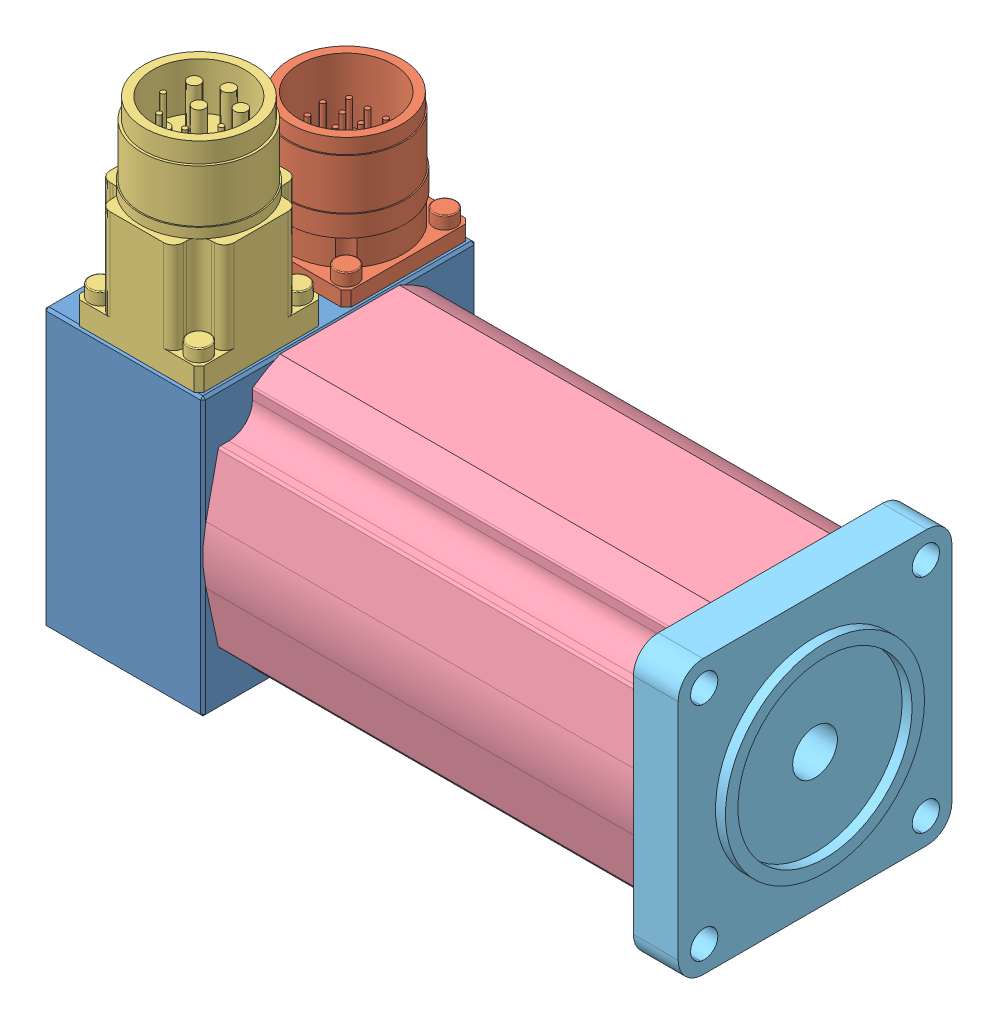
SolidWorks assembly SERVO-MOTEUR - BSH0551 - SCHNEIDER.SLDASM, configuration Défaut (file format 3100). Lengths in mm.
Overall size (129.5 95.23 55.02).
5 component instances, 5 part files, 0 mates.
Components (placement in the parent):
- B_Lagerschild_055-1: B_Lagerschild_055.sldprt [Défaut] at origin size (32 55.73 55.02)
- Stecker_Leistung___gerade_BSH_055-1: Stecker_Leistung___gerade_BSH_055.sldprt [Défaut] at (13.5 27.5 -14.8) x (0 1 0) z (-1 0 0) size (25.5 25 25)
- Stecker_Signal___gerade_BSH_055-1: Stecker_Signal___gerade_BSH_055.sldprt [Défaut] at (13.5 27.5 14.8) x (0 1 0) z (-1 0 0) size (39.5 25 25)
- Housing_055__88_5_-1: Housing_055__88_5_.sldprt [Défaut] at (27 0 0) size (86.5 55 55)
- A_Lagerschild_055-1: A_Lagerschild_055.sldprt [Défaut] at (122.5 0 0) x (-1 0 0) z (0 0 1) size (11 55 55)
